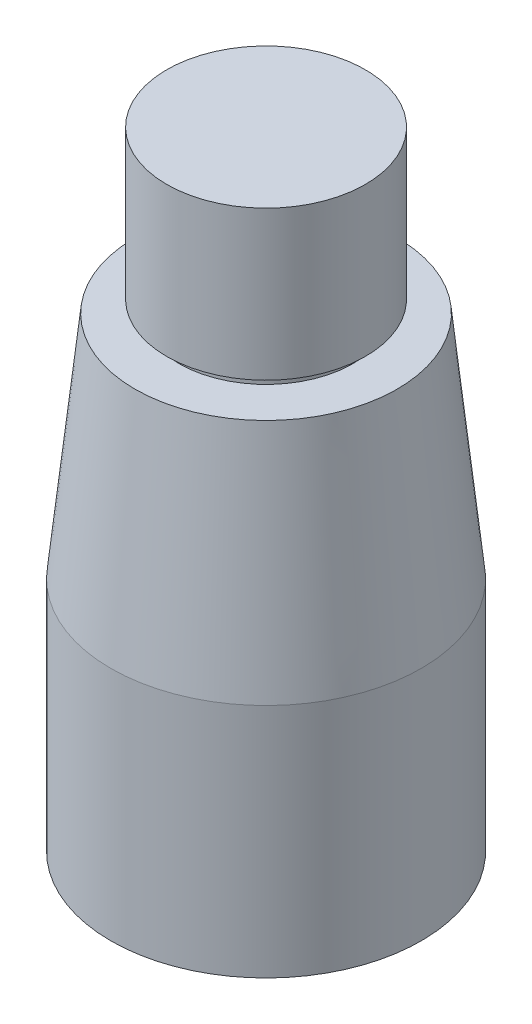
ISO-10303-21;
HEADER;
FILE_DESCRIPTION(('STEP AP214'),'2;1');
FILE_NAME('part.step','',(''),(''),'','','');
FILE_SCHEMA(('AUTOMOTIVE_DESIGN { 1 0 10303 214 1 1 1 1 }'));
ENDSEC;
DATA;
#1=APPLICATION_CONTEXT('core data for automotive mechanical design processes');
#2=APPLICATION_PROTOCOL_DEFINITION('international standard','automotive_design',2000,#1);
#3=PRODUCT_CONTEXT('',#1,'mechanical');
#4=PRODUCT('Part','Part','',(#3));
#5=PRODUCT_RELATED_PRODUCT_CATEGORY('part','',(#4));
#6=PRODUCT_DEFINITION_FORMATION('','',#4);
#7=PRODUCT_DEFINITION_CONTEXT('part definition',#1,'design');
#8=PRODUCT_DEFINITION('design','',#6,#7);
#9=PRODUCT_DEFINITION_SHAPE('','',#8);
#10=(LENGTH_UNIT() NAMED_UNIT(*) SI_UNIT(.MILLI.,.METRE.));
#11=(NAMED_UNIT(*) PLANE_ANGLE_UNIT() SI_UNIT($,.RADIAN.));
#12=(NAMED_UNIT(*) SI_UNIT($,.STERADIAN.) SOLID_ANGLE_UNIT());
#13=UNCERTAINTY_MEASURE_WITH_UNIT(LENGTH_MEASURE(1.E-05),#10,'distance_accuracy_value','');
#14=(GEOMETRIC_REPRESENTATION_CONTEXT(3) GLOBAL_UNCERTAINTY_ASSIGNED_CONTEXT((#13)) GLOBAL_UNIT_ASSIGNED_CONTEXT((#10,
#11,#12)) REPRESENTATION_CONTEXT('',''));
#15=CARTESIAN_POINT('',(0.,0.,0.));
#16=DIRECTION('',(0.,0.,1.));
#17=DIRECTION('',(1.,0.,0.));
#18=AXIS2_PLACEMENT_3D('',#15,#16,#17);
#19=CARTESIAN_POINT('',(0.,0.,0.));
#20=DIRECTION('',(0.,-1.,0.));
#21=DIRECTION('',(0.,0.,-1.));
#22=AXIS2_PLACEMENT_3D('',#19,#20,#21);
#23=PLANE('',#22);
#24=CARTESIAN_POINT('',(0.,0.,0.));
#25=DIRECTION('',(0.,1.,0.));
#26=DIRECTION('',(0.,0.,1.));
#27=AXIS2_PLACEMENT_3D('',#24,#25,#26);
#28=CIRCLE('',#27,12.5);
#29=CARTESIAN_POINT('',(0.,0.,12.5));
#30=VERTEX_POINT('',#29);
#31=EDGE_CURVE('E10',#30,#30,#28,.T.);
#32=ORIENTED_EDGE('',*,*,#31,.F.);
#33=EDGE_LOOP('',(#32));
#34=FACE_BOUND('',#33,.T.);
#35=ADVANCED_FACE('F31',(#34),#23,.T.);
#36=CARTESIAN_POINT('',(0.,85.1026449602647,0.));
#37=DIRECTION('',(0.,1.,0.));
#38=DIRECTION('',(0.,0.,1.));
#39=AXIS2_PLACEMENT_3D('',#36,#37,#38);
#40=CYLINDRICAL_SURFACE('',#39,12.5);
#41=ORIENTED_EDGE('',*,*,#31,.T.);
#42=EDGE_LOOP('',(#41));
#43=FACE_BOUND('',#42,.T.);
#44=CARTESIAN_POINT('',(0.,19.,0.));
#45=DIRECTION('',(0.,1.,0.));
#46=DIRECTION('',(0.,0.,1.));
#47=AXIS2_PLACEMENT_3D('',#44,#45,#46);
#48=CIRCLE('',#47,12.5);
#49=CARTESIAN_POINT('',(0.,19.,12.5));
#50=VERTEX_POINT('',#49);
#51=EDGE_CURVE('E37',#50,#50,#48,.T.);
#52=ORIENTED_EDGE('',*,*,#51,.F.);
#53=EDGE_LOOP('',(#52));
#54=FACE_BOUND('',#53,.T.);
#55=ADVANCED_FACE('F76',(#43,#54),#40,.T.);
#56=CARTESIAN_POINT('',(0.,37.5,0.));
#57=DIRECTION('',(0.,-1.,0.));
#58=DIRECTION('',(0.,0.,-1.));
#59=AXIS2_PLACEMENT_3D('',#56,#57,#58);
#60=CONICAL_SURFACE('',#59,10.555571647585,0.10471975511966);
#61=ORIENTED_EDGE('',*,*,#51,.T.);
#62=EDGE_LOOP('',(#61));
#63=FACE_BOUND('',#62,.T.);
#64=CARTESIAN_POINT('',(0.,37.5,0.));
#65=DIRECTION('',(0.,1.,0.));
#66=DIRECTION('',(0.,0.,1.));
#67=AXIS2_PLACEMENT_3D('',#64,#65,#66);
#68=CIRCLE('',#67,10.555571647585);
#69=CARTESIAN_POINT('',(0.,37.5,10.555571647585));
#70=VERTEX_POINT('',#69);
#71=EDGE_CURVE('E41',#70,#70,#68,.T.);
#72=ORIENTED_EDGE('',*,*,#71,.F.);
#73=EDGE_LOOP('',(#72));
#74=FACE_BOUND('',#73,.T.);
#75=ADVANCED_FACE('F81',(#63,#74),#60,.T.);
#76=CARTESIAN_POINT('',(-10.555571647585,37.5,0.));
#77=DIRECTION('',(0.,1.,0.));
#78=DIRECTION('',(0.,0.,1.));
#79=AXIS2_PLACEMENT_3D('',#76,#77,#78);
#80=PLANE('',#79);
#81=ORIENTED_EDGE('',*,*,#71,.T.);
#82=EDGE_LOOP('',(#81));
#83=FACE_BOUND('',#82,.T.);
#84=CARTESIAN_POINT('',(0.,37.5,0.));
#85=DIRECTION('',(0.,1.,0.));
#86=DIRECTION('',(0.,0.,1.));
#87=AXIS2_PLACEMENT_3D('',#84,#85,#86);
#88=CIRCLE('',#87,7.);
#89=CARTESIAN_POINT('',(0.,37.5,7.));
#90=VERTEX_POINT('',#89);
#91=EDGE_CURVE('E45',#90,#90,#88,.T.);
#92=ORIENTED_EDGE('',*,*,#91,.F.);
#93=EDGE_LOOP('',(#92));
#94=FACE_BOUND('',#93,.T.);
#95=ADVANCED_FACE('F85',(#83,#94),#80,.T.);
#96=CARTESIAN_POINT('',(0.,85.1026449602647,0.));
#97=DIRECTION('',(0.,1.,0.));
#98=DIRECTION('',(0.,0.,1.));
#99=AXIS2_PLACEMENT_3D('',#96,#97,#98);
#100=CYLINDRICAL_SURFACE('',#99,7.);
#101=ORIENTED_EDGE('',*,*,#91,.T.);
#102=EDGE_LOOP('',(#101));
#103=FACE_BOUND('',#102,.T.);
#104=CARTESIAN_POINT('',(0.,38.5,0.));
#105=DIRECTION('',(0.,1.,0.));
#106=DIRECTION('',(0.,0.,1.));
#107=AXIS2_PLACEMENT_3D('',#104,#105,#106);
#108=CIRCLE('',#107,7.);
#109=CARTESIAN_POINT('',(0.,38.5,7.));
#110=VERTEX_POINT('',#109);
#111=EDGE_CURVE('E50',#110,#110,#108,.T.);
#112=ORIENTED_EDGE('',*,*,#111,.F.);
#113=EDGE_LOOP('',(#112));
#114=FACE_BOUND('',#113,.T.);
#115=ADVANCED_FACE('F72',(#103,#114),#100,.T.);
#116=CARTESIAN_POINT('',(-7.,38.5,0.));
#117=DIRECTION('',(0.,-1.,0.));
#118=DIRECTION('',(0.,0.,-1.));
#119=AXIS2_PLACEMENT_3D('',#116,#117,#118);
#120=PLANE('',#119);
#121=ORIENTED_EDGE('',*,*,#111,.T.);
#122=EDGE_LOOP('',(#121));
#123=FACE_BOUND('',#122,.T.);
#124=CARTESIAN_POINT('',(0.,38.5,0.));
#125=DIRECTION('',(0.,1.,0.));
#126=DIRECTION('',(0.,0.,1.));
#127=AXIS2_PLACEMENT_3D('',#124,#125,#126);
#128=CIRCLE('',#127,8.);
#129=CARTESIAN_POINT('',(0.,38.5,8.));
#130=VERTEX_POINT('',#129);
#131=EDGE_CURVE('E53',#130,#130,#128,.T.);
#132=ORIENTED_EDGE('',*,*,#131,.F.);
#133=EDGE_LOOP('',(#132));
#134=FACE_BOUND('',#133,.T.);
#135=ADVANCED_FACE('F64',(#123,#134),#120,.T.);
#136=CARTESIAN_POINT('',(0.,85.1026449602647,0.));
#137=DIRECTION('',(0.,1.,0.));
#138=DIRECTION('',(0.,0.,1.));
#139=AXIS2_PLACEMENT_3D('',#136,#137,#138);
#140=CYLINDRICAL_SURFACE('',#139,8.);
#141=ORIENTED_EDGE('',*,*,#131,.T.);
#142=EDGE_LOOP('',(#141));
#143=FACE_BOUND('',#142,.T.);
#144=CARTESIAN_POINT('',(0.,50.5,0.));
#145=DIRECTION('',(0.,1.,0.));
#146=DIRECTION('',(0.,0.,1.));
#147=AXIS2_PLACEMENT_3D('',#144,#145,#146);
#148=CIRCLE('',#147,8.);
#149=CARTESIAN_POINT('',(0.,50.5,8.));
#150=VERTEX_POINT('',#149);
#151=EDGE_CURVE('E56',#150,#150,#148,.T.);
#152=ORIENTED_EDGE('',*,*,#151,.F.);
#153=EDGE_LOOP('',(#152));
#154=FACE_BOUND('',#153,.T.);
#155=ADVANCED_FACE('F62',(#143,#154),#140,.T.);
#156=CARTESIAN_POINT('',(-8.,50.5,0.));
#157=DIRECTION('',(0.,1.,0.));
#158=DIRECTION('',(0.,0.,1.));
#159=AXIS2_PLACEMENT_3D('',#156,#157,#158);
#160=PLANE('',#159);
#161=ORIENTED_EDGE('',*,*,#151,.T.);
#162=EDGE_LOOP('',(#161));
#163=FACE_BOUND('',#162,.T.);
#164=ADVANCED_FACE('F60',(#163),#160,.T.);
#165=CLOSED_SHELL('',(#35,#55,#75,#95,#115,#135,#155,#164));
#166=MANIFOLD_SOLID_BREP('B2',#165);
#167=ADVANCED_BREP_SHAPE_REPRESENTATION('',(#18,#166),#14);
#168=SHAPE_DEFINITION_REPRESENTATION(#9,#167);
ENDSEC;
END-ISO-10303-21;
